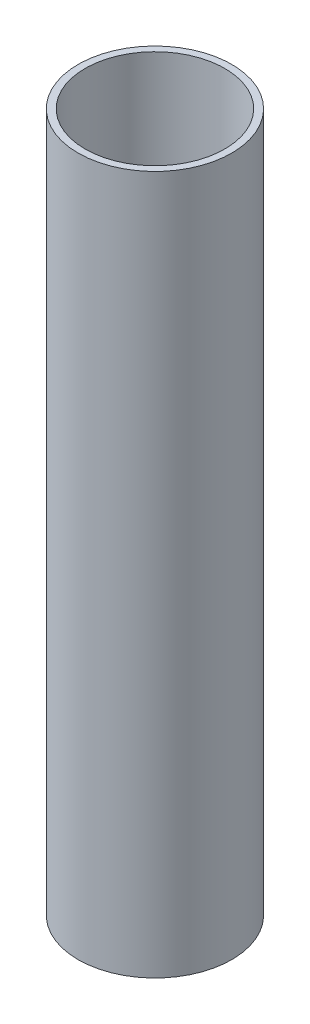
from build123d import *

# Parameters (mm, degrees)
ESQUISSE1_R            = 110
FORME_EXT_RIEURE_DEPTH = 1000
TROU_T                 = -10


with BuildPart() as part:
    # Esquisse1 → Forme ext_rieure (new body)
    with BuildSketch(Plane(origin=(0, 0, 0), x_dir=(1, 0, 0), z_dir=(0, 1, 0))):
        with Locations(Location((0, 0, 0), (0, 0, 270))):
            Circle(ESQUISSE1_R)
    extrude(amount=FORME_EXT_RIEURE_DEPTH)

    # Trou
    trou_openings = [part.faces().sort_by_distance(p)[0] for p in [
        (0, 1000, 0),
        (0, 0, 0),
    ]]
    offset(amount=TROU_T, openings=trou_openings, kind=Kind.INTERSECTION)


solid = part.part
